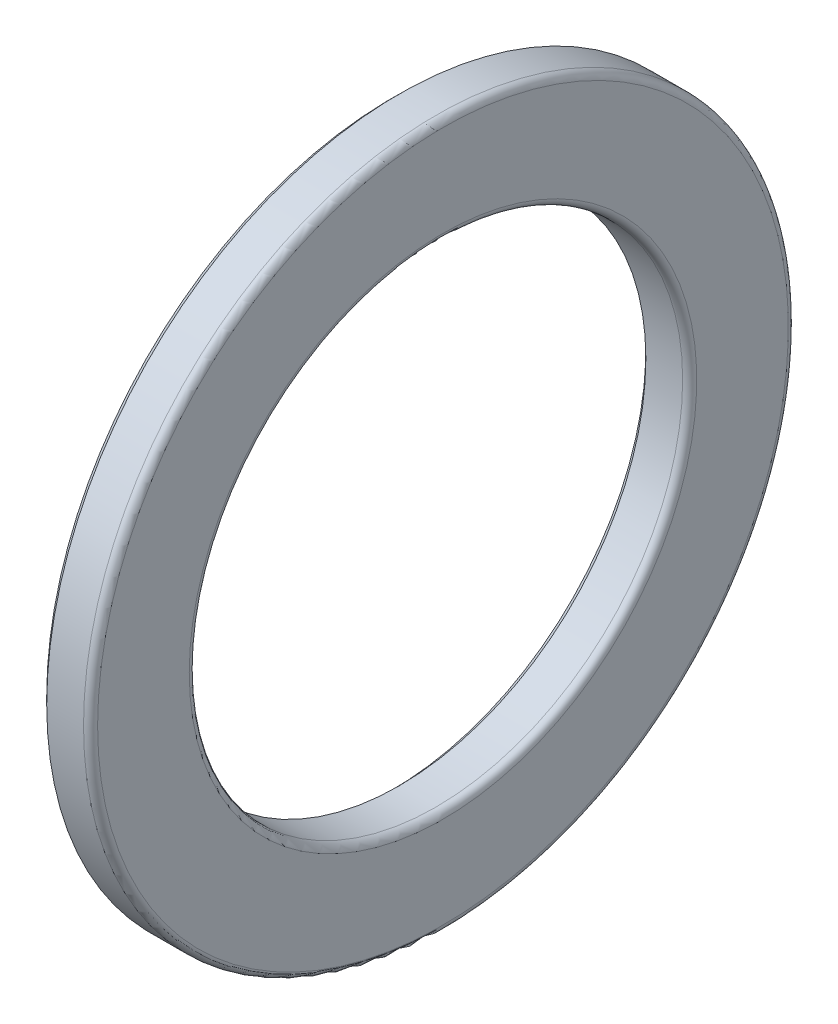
ISO-10303-21;
HEADER;
FILE_DESCRIPTION(('STEP AP214'),'2;1');
FILE_NAME('part.step','',(''),(''),'','','');
FILE_SCHEMA(('AUTOMOTIVE_DESIGN { 1 0 10303 214 1 1 1 1 }'));
ENDSEC;
DATA;
#1=APPLICATION_CONTEXT('core data for automotive mechanical design processes');
#2=APPLICATION_PROTOCOL_DEFINITION('international standard','automotive_design',2000,#1);
#3=PRODUCT_CONTEXT('',#1,'mechanical');
#4=PRODUCT('Part','Part','',(#3));
#5=PRODUCT_RELATED_PRODUCT_CATEGORY('part','',(#4));
#6=PRODUCT_DEFINITION_FORMATION('','',#4);
#7=PRODUCT_DEFINITION_CONTEXT('part definition',#1,'design');
#8=PRODUCT_DEFINITION('design','',#6,#7);
#9=PRODUCT_DEFINITION_SHAPE('','',#8);
#10=(LENGTH_UNIT() NAMED_UNIT(*) SI_UNIT(.MILLI.,.METRE.));
#11=(NAMED_UNIT(*) PLANE_ANGLE_UNIT() SI_UNIT($,.RADIAN.));
#12=(NAMED_UNIT(*) SI_UNIT($,.STERADIAN.) SOLID_ANGLE_UNIT());
#13=UNCERTAINTY_MEASURE_WITH_UNIT(LENGTH_MEASURE(1.E-05),#10,'distance_accuracy_value','');
#14=(GEOMETRIC_REPRESENTATION_CONTEXT(3) GLOBAL_UNCERTAINTY_ASSIGNED_CONTEXT((#13)) GLOBAL_UNIT_ASSIGNED_CONTEXT((#10,
#11,#12)) REPRESENTATION_CONTEXT('',''));
#15=CARTESIAN_POINT('',(0.,0.,0.));
#16=DIRECTION('',(0.,0.,1.));
#17=DIRECTION('',(1.,0.,0.));
#18=AXIS2_PLACEMENT_3D('',#15,#16,#17);
#19=CARTESIAN_POINT('',(8.66666666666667,0.,0.));
#20=DIRECTION('',(-1.,0.,0.));
#21=DIRECTION('',(0.,0.,1.));
#22=AXIS2_PLACEMENT_3D('',#19,#20,#21);
#23=CONICAL_SURFACE('',#22,21.6,0.78539816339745);
#24=CARTESIAN_POINT('',(9.26666666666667,0.,0.));
#25=DIRECTION('',(-1.,0.,0.));
#26=DIRECTION('',(0.,0.,1.));
#27=AXIS2_PLACEMENT_3D('',#24,#25,#26);
#28=CIRCLE('',#27,21.);
#29=CARTESIAN_POINT('',(9.26666666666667,0.,21.));
#30=VERTEX_POINT('',#29);
#31=EDGE_CURVE('E10',#30,#30,#28,.T.);
#32=ORIENTED_EDGE('',*,*,#31,.F.);
#33=EDGE_LOOP('',(#32));
#34=FACE_BOUND('',#33,.T.);
#35=CARTESIAN_POINT('',(8.66666666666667,0.,0.));
#36=DIRECTION('',(-1.,0.,0.));
#37=DIRECTION('',(0.,0.,1.));
#38=AXIS2_PLACEMENT_3D('',#35,#36,#37);
#39=CIRCLE('',#38,21.6);
#40=CARTESIAN_POINT('',(8.66666666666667,0.,21.6));
#41=VERTEX_POINT('',#40);
#42=EDGE_CURVE('E48',#41,#41,#39,.T.);
#43=ORIENTED_EDGE('',*,*,#42,.T.);
#44=EDGE_LOOP('',(#43));
#45=FACE_BOUND('',#44,.T.);
#46=ADVANCED_FACE('F14',(#34,#45),#23,.F.);
#47=CARTESIAN_POINT('',(0.,0.,0.));
#48=DIRECTION('',(-1.,0.,0.));
#49=DIRECTION('',(0.,0.,1.));
#50=AXIS2_PLACEMENT_3D('',#47,#48,#49);
#51=CYLINDRICAL_SURFACE('',#50,21.);
#52=CARTESIAN_POINT('',(12.4,0.,0.));
#53=DIRECTION('',(-1.,0.,0.));
#54=DIRECTION('',(0.,0.,1.));
#55=AXIS2_PLACEMENT_3D('',#52,#53,#54);
#56=CIRCLE('',#55,21.);
#57=CARTESIAN_POINT('',(12.4,0.,21.));
#58=VERTEX_POINT('',#57);
#59=EDGE_CURVE('E20',#58,#58,#56,.T.);
#60=ORIENTED_EDGE('',*,*,#59,.F.);
#61=EDGE_LOOP('',(#60));
#62=FACE_BOUND('',#61,.T.);
#63=ORIENTED_EDGE('',*,*,#31,.T.);
#64=EDGE_LOOP('',(#63));
#65=FACE_BOUND('',#64,.T.);
#66=ADVANCED_FACE('F72',(#62,#65),#51,.F.);
#67=CARTESIAN_POINT('',(12.4,0.,0.));
#68=DIRECTION('',(-1.,0.,0.));
#69=DIRECTION('',(0.,0.,1.));
#70=AXIS2_PLACEMENT_3D('',#67,#68,#69);
#71=TOROIDAL_SURFACE('',#70,21.6,0.6);
#72=CARTESIAN_POINT('',(13.,0.,0.));
#73=DIRECTION('',(-1.,0.,0.));
#74=DIRECTION('',(0.,0.,1.));
#75=AXIS2_PLACEMENT_3D('',#72,#73,#74);
#76=CIRCLE('',#75,21.6);
#77=CARTESIAN_POINT('',(13.,0.,21.6));
#78=VERTEX_POINT('',#77);
#79=EDGE_CURVE('E24',#78,#78,#76,.T.);
#80=ORIENTED_EDGE('',*,*,#79,.F.);
#81=EDGE_LOOP('',(#80));
#82=FACE_BOUND('',#81,.T.);
#83=ORIENTED_EDGE('',*,*,#59,.T.);
#84=EDGE_LOOP('',(#83));
#85=FACE_BOUND('',#84,.T.);
#86=ADVANCED_FACE('F77',(#82,#85),#71,.T.);
#87=CARTESIAN_POINT('',(13.,21.6,0.));
#88=DIRECTION('',(-1.,0.,0.));
#89=DIRECTION('',(0.,0.,1.));
#90=AXIS2_PLACEMENT_3D('',#87,#88,#89);
#91=PLANE('',#90);
#92=CARTESIAN_POINT('',(13.,0.,0.));
#93=DIRECTION('',(-1.,0.,0.));
#94=DIRECTION('',(0.,0.,1.));
#95=AXIS2_PLACEMENT_3D('',#92,#93,#94);
#96=CIRCLE('',#95,29.4);
#97=CARTESIAN_POINT('',(13.,0.,29.4));
#98=VERTEX_POINT('',#97);
#99=EDGE_CURVE('E28',#98,#98,#96,.T.);
#100=ORIENTED_EDGE('',*,*,#99,.F.);
#101=EDGE_LOOP('',(#100));
#102=FACE_BOUND('',#101,.T.);
#103=ORIENTED_EDGE('',*,*,#79,.T.);
#104=EDGE_LOOP('',(#103));
#105=FACE_BOUND('',#104,.T.);
#106=ADVANCED_FACE('F82',(#102,#105),#91,.F.);
#107=CARTESIAN_POINT('',(12.4,0.,0.));
#108=DIRECTION('',(-1.,0.,0.));
#109=DIRECTION('',(0.,0.,1.));
#110=AXIS2_PLACEMENT_3D('',#107,#108,#109);
#111=TOROIDAL_SURFACE('',#110,29.4,0.6);
#112=CARTESIAN_POINT('',(12.4,0.,0.));
#113=DIRECTION('',(-1.,0.,0.));
#114=DIRECTION('',(0.,0.,1.));
#115=AXIS2_PLACEMENT_3D('',#112,#113,#114);
#116=CIRCLE('',#115,30.);
#117=CARTESIAN_POINT('',(12.4,0.,30.));
#118=VERTEX_POINT('',#117);
#119=EDGE_CURVE('E33',#118,#118,#116,.T.);
#120=ORIENTED_EDGE('',*,*,#119,.F.);
#121=EDGE_LOOP('',(#120));
#122=FACE_BOUND('',#121,.T.);
#123=ORIENTED_EDGE('',*,*,#99,.T.);
#124=EDGE_LOOP('',(#123));
#125=FACE_BOUND('',#124,.T.);
#126=ADVANCED_FACE('F88',(#122,#125),#111,.T.);
#127=CARTESIAN_POINT('',(0.,0.,0.));
#128=DIRECTION('',(-1.,0.,0.));
#129=DIRECTION('',(0.,0.,1.));
#130=AXIS2_PLACEMENT_3D('',#127,#128,#129);
#131=CYLINDRICAL_SURFACE('',#130,30.);
#132=CARTESIAN_POINT('',(9.26666666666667,0.,0.));
#133=DIRECTION('',(-1.,0.,0.));
#134=DIRECTION('',(0.,0.,1.));
#135=AXIS2_PLACEMENT_3D('',#132,#133,#134);
#136=CIRCLE('',#135,30.);
#137=CARTESIAN_POINT('',(9.26666666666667,0.,30.));
#138=VERTEX_POINT('',#137);
#139=EDGE_CURVE('E36',#138,#138,#136,.T.);
#140=ORIENTED_EDGE('',*,*,#139,.F.);
#141=EDGE_LOOP('',(#140));
#142=FACE_BOUND('',#141,.T.);
#143=ORIENTED_EDGE('',*,*,#119,.T.);
#144=EDGE_LOOP('',(#143));
#145=FACE_BOUND('',#144,.T.);
#146=ADVANCED_FACE('F92',(#142,#145),#131,.T.);
#147=CARTESIAN_POINT('',(9.26666666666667,0.,0.));
#148=DIRECTION('',(1.,0.,0.));
#149=DIRECTION('',(0.,0.,-1.));
#150=AXIS2_PLACEMENT_3D('',#147,#148,#149);
#151=CONICAL_SURFACE('',#150,30.,0.78539816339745);
#152=CARTESIAN_POINT('',(8.66666666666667,0.,0.));
#153=DIRECTION('',(-1.,0.,0.));
#154=DIRECTION('',(0.,0.,1.));
#155=AXIS2_PLACEMENT_3D('',#152,#153,#154);
#156=CIRCLE('',#155,29.4);
#157=CARTESIAN_POINT('',(8.66666666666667,0.,29.4));
#158=VERTEX_POINT('',#157);
#159=EDGE_CURVE('E39',#158,#158,#156,.T.);
#160=ORIENTED_EDGE('',*,*,#159,.F.);
#161=EDGE_LOOP('',(#160));
#162=FACE_BOUND('',#161,.T.);
#163=ORIENTED_EDGE('',*,*,#139,.T.);
#164=EDGE_LOOP('',(#163));
#165=FACE_BOUND('',#164,.T.);
#166=ADVANCED_FACE('F68',(#162,#165),#151,.T.);
#167=CARTESIAN_POINT('',(8.66666666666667,29.4,0.));
#168=DIRECTION('',(1.,0.,0.));
#169=DIRECTION('',(0.,0.,-1.));
#170=AXIS2_PLACEMENT_3D('',#167,#168,#169);
#171=PLANE('',#170);
#172=CARTESIAN_POINT('',(8.66666666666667,0.,0.));
#173=DIRECTION('',(-1.,0.,0.));
#174=DIRECTION('',(0.,0.,1.));
#175=AXIS2_PLACEMENT_3D('',#172,#173,#174);
#176=CIRCLE('',#175,27.4224069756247);
#177=CARTESIAN_POINT('',(8.66666666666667,0.,27.4224069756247));
#178=VERTEX_POINT('',#177);
#179=EDGE_CURVE('E42',#178,#178,#176,.T.);
#180=ORIENTED_EDGE('',*,*,#179,.F.);
#181=EDGE_LOOP('',(#180));
#182=FACE_BOUND('',#181,.T.);
#183=ORIENTED_EDGE('',*,*,#159,.T.);
#184=EDGE_LOOP('',(#183));
#185=FACE_BOUND('',#184,.T.);
#186=ADVANCED_FACE('F61',(#182,#185),#171,.F.);
#187=CARTESIAN_POINT('',(6.5,0.,0.));
#188=DIRECTION('',(-1.,0.,0.));
#189=DIRECTION('',(0.,0.,1.));
#190=AXIS2_PLACEMENT_3D('',#187,#188,#189);
#191=TOROIDAL_SURFACE('',#190,25.,3.25);
#192=ORIENTED_EDGE('',*,*,#179,.T.);
#193=EDGE_LOOP('',(#192));
#194=FACE_BOUND('',#193,.T.);
#195=CARTESIAN_POINT('',(8.66666666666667,0.,0.));
#196=DIRECTION('',(-1.,0.,0.));
#197=DIRECTION('',(0.,0.,1.));
#198=AXIS2_PLACEMENT_3D('',#195,#196,#197);
#199=CIRCLE('',#198,22.5775930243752);
#200=CARTESIAN_POINT('',(8.66666666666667,0.,22.5775930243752));
#201=VERTEX_POINT('',#200);
#202=EDGE_CURVE('E45',#201,#201,#199,.T.);
#203=ORIENTED_EDGE('',*,*,#202,.F.);
#204=EDGE_LOOP('',(#203));
#205=FACE_BOUND('',#204,.T.);
#206=ADVANCED_FACE('F56',(#194,#205),#191,.F.);
#207=CARTESIAN_POINT('',(8.66666666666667,22.5775930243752,0.));
#208=DIRECTION('',(1.,0.,0.));
#209=DIRECTION('',(0.,0.,-1.));
#210=AXIS2_PLACEMENT_3D('',#207,#208,#209);
#211=PLANE('',#210);
#212=ORIENTED_EDGE('',*,*,#42,.F.);
#213=EDGE_LOOP('',(#212));
#214=FACE_BOUND('',#213,.T.);
#215=ORIENTED_EDGE('',*,*,#202,.T.);
#216=EDGE_LOOP('',(#215));
#217=FACE_BOUND('',#216,.T.);
#218=ADVANCED_FACE('F53',(#214,#217),#211,.F.);
#219=CLOSED_SHELL('',(#46,#66,#86,#106,#126,#146,#166,#186,#206,#218));
#220=MANIFOLD_SOLID_BREP('B1',#219);
#221=ADVANCED_BREP_SHAPE_REPRESENTATION('',(#18,#220),#14);
#222=SHAPE_DEFINITION_REPRESENTATION(#9,#221);
ENDSEC;
END-ISO-10303-21;
